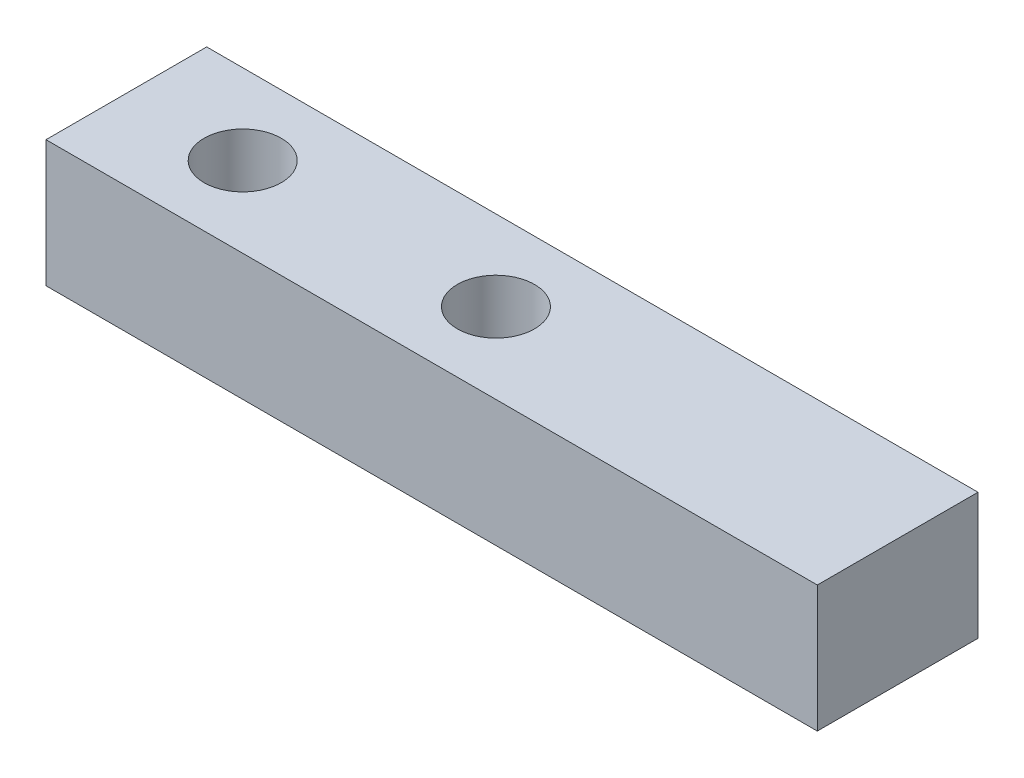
from build123d import *

# Parameters (mm, degrees)
SKETCH1_W           = 6.35
SKETCH1_H           = 5
BOSS_EXTRUDE1_DEPTH = 30.48
CUT_EXTRUDE1_REACH  = 33.05
SKETCH2_R           = 1.524


with BuildPart() as part:
    # Sketch1 → Boss-Extrude1 (new body)
    with BuildSketch(Plane(origin=(0, 0, 0), x_dir=(0, 0, -1), z_dir=(1, 0, 0))):
        Rectangle(SKETCH1_W, SKETCH1_H)
    extrude(amount=BOSS_EXTRUDE1_DEPTH)

    # Sketch2 → Cut-Extrude1 (cut, up to next)
    with BuildSketch(Plane(origin=(0, 2.5, 0), x_dir=(1, 0, 0), z_dir=(0, 1, 0)), mode=Mode.PRIVATE) as cut_extrude1_sk1:
        with Locations(Location((14.605, 0, 0), (0, 0, 270))):
            Circle(SKETCH2_R)
    cut_extrude1_tool1 = extrude(cut_extrude1_sk1.sketch, amount=-CUT_EXTRUDE1_REACH, mode=Mode.PRIVATE) & part.part
    # Sketch2 → Cut-Extrude1 (cut, up to next)
    with BuildSketch(Plane(origin=(0, 2.5, 0), x_dir=(1, 0, 0), z_dir=(0, 1, 0)), mode=Mode.PRIVATE) as cut_extrude1_sk2:
        with Locations(Location((4.5974, 0, 0), (0, 0, 270))):
            Circle(SKETCH2_R)
    cut_extrude1_tool2 = extrude(cut_extrude1_sk2.sketch, amount=-CUT_EXTRUDE1_REACH, mode=Mode.PRIVATE) & part.part
    add(cut_extrude1_tool1.solids().sort_by_distance((14.605, 2.5, 0))[0], mode=Mode.SUBTRACT)
    add(cut_extrude1_tool2.solids().sort_by_distance((4.5974, 2.5, 0))[0], mode=Mode.SUBTRACT)


solid = part.part
